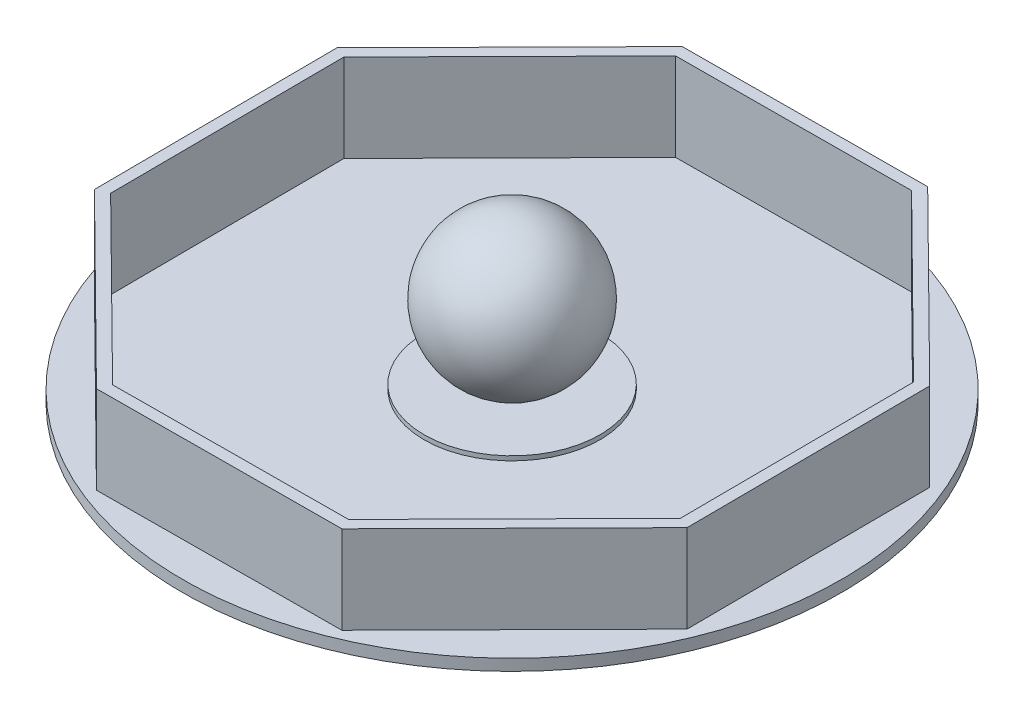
ISO-10303-21;
HEADER;
FILE_DESCRIPTION(('STEP AP214'),'2;1');
FILE_NAME('part.step','',(''),(''),'','','');
FILE_SCHEMA(('AUTOMOTIVE_DESIGN { 1 0 10303 214 1 1 1 1 }'));
ENDSEC;
DATA;
#1=APPLICATION_CONTEXT('core data for automotive mechanical design processes');
#2=APPLICATION_PROTOCOL_DEFINITION('international standard','automotive_design',2000,#1);
#3=PRODUCT_CONTEXT('',#1,'mechanical');
#4=PRODUCT('Part','Part','',(#3));
#5=PRODUCT_RELATED_PRODUCT_CATEGORY('part','',(#4));
#6=PRODUCT_DEFINITION_FORMATION('','',#4);
#7=PRODUCT_DEFINITION_CONTEXT('part definition',#1,'design');
#8=PRODUCT_DEFINITION('design','',#6,#7);
#9=PRODUCT_DEFINITION_SHAPE('','',#8);
#10=(LENGTH_UNIT() NAMED_UNIT(*) SI_UNIT(.MILLI.,.METRE.));
#11=(NAMED_UNIT(*) PLANE_ANGLE_UNIT() SI_UNIT($,.RADIAN.));
#12=(NAMED_UNIT(*) SI_UNIT($,.STERADIAN.) SOLID_ANGLE_UNIT());
#13=UNCERTAINTY_MEASURE_WITH_UNIT(LENGTH_MEASURE(1.E-05),#10,'distance_accuracy_value','');
#14=(GEOMETRIC_REPRESENTATION_CONTEXT(3) GLOBAL_UNCERTAINTY_ASSIGNED_CONTEXT((#13)) GLOBAL_UNIT_ASSIGNED_CONTEXT((#10,
#11,#12)) REPRESENTATION_CONTEXT('',''));
#15=CARTESIAN_POINT('',(0.,0.,0.));
#16=DIRECTION('',(0.,0.,1.));
#17=DIRECTION('',(1.,0.,0.));
#18=AXIS2_PLACEMENT_3D('',#15,#16,#17);
#19=CARTESIAN_POINT('',(0.,25.908,0.));
#20=DIRECTION('',(-1.,0.,0.));
#21=DIRECTION('',(0.,0.,-1.));
#22=AXIS2_PLACEMENT_3D('',#19,#20,#21);
#23=SPHERICAL_SURFACE('',#22,21.336);
#24=CARTESIAN_POINT('',(-21.336,25.908,0.));
#25=VERTEX_POINT('',#24);
#26=VERTEX_LOOP('',#25);
#27=FACE_BOUND('',#26,.T.);
#28=ADVANCED_FACE('F47',(#27),#23,.T.);
#29=CLOSED_SHELL('',(#28));
#30=MANIFOLD_SOLID_BREP('B2',#29);
#31=CARTESIAN_POINT('',(0.,3.302,0.));
#32=DIRECTION('',(0.,1.,0.));
#33=DIRECTION('',(0.,0.,1.));
#34=AXIS2_PLACEMENT_3D('',#31,#32,#33);
#35=PLANE('',#34);
#36=DIRECTION('',(-0.711251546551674,0.,-0.702937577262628));
#37=VECTOR('',#36,1.);
#38=CARTESIAN_POINT('',(81.640686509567,3.302,-34.380363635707));
#39=LINE('',#38,#37);
#40=CARTESIAN_POINT('',(81.6406865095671,3.302,-34.380363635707));
#41=VERTEX_POINT('',#40);
#42=CARTESIAN_POINT('',(33.4180947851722,3.302,-82.0392713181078));
#43=VERTEX_POINT('',#42);
#44=EDGE_CURVE('E86',#41,#43,#39,.T.);
#45=ORIENTED_EDGE('',*,*,#44,.T.);
#46=DIRECTION('',(-0.999982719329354,0.,0.00587886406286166));
#47=VECTOR('',#46,1.);
#48=CARTESIAN_POINT('',(33.4180947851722,3.302,-82.0392713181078));
#49=LINE('',#48,#47);
#50=CARTESIAN_POINT('',(-34.380363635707,3.302,-81.640686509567));
#51=VERTEX_POINT('',#50);
#52=EDGE_CURVE('E195',#43,#51,#49,.T.);
#53=ORIENTED_EDGE('',*,*,#52,.T.);
#54=DIRECTION('',(-0.702937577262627,0.,0.711251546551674));
#55=VECTOR('',#54,1.);
#56=CARTESIAN_POINT('',(-34.380363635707,3.302,-81.640686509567));
#57=LINE('',#56,#55);
#58=CARTESIAN_POINT('',(-82.0392713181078,3.302,-33.4180947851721));
#59=VERTEX_POINT('',#58);
#60=EDGE_CURVE('E231',#51,#59,#57,.T.);
#61=ORIENTED_EDGE('',*,*,#60,.T.);
#62=DIRECTION('',(0.00587886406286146,0.,0.999982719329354));
#63=VECTOR('',#62,1.);
#64=CARTESIAN_POINT('',(-82.0392713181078,3.302,-33.4180947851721));
#65=LINE('',#64,#63);
#66=CARTESIAN_POINT('',(-81.640686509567,3.302,34.380363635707));
#67=VERTEX_POINT('',#66);
#68=EDGE_CURVE('E234',#59,#67,#65,.T.);
#69=ORIENTED_EDGE('',*,*,#68,.T.);
#70=DIRECTION('',(0.711251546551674,0.,0.702937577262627));
#71=VECTOR('',#70,1.);
#72=CARTESIAN_POINT('',(-81.640686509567,3.302,34.380363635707));
#73=LINE('',#72,#71);
#74=CARTESIAN_POINT('',(-33.4180947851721,3.302,82.0392713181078));
#75=VERTEX_POINT('',#74);
#76=EDGE_CURVE('E237',#67,#75,#73,.T.);
#77=ORIENTED_EDGE('',*,*,#76,.T.);
#78=DIRECTION('',(0.999982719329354,0.,-0.00587886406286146));
#79=VECTOR('',#78,1.);
#80=CARTESIAN_POINT('',(-33.4180947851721,3.302,82.0392713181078));
#81=LINE('',#80,#79);
#82=CARTESIAN_POINT('',(34.380363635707,3.302,81.6406865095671));
#83=VERTEX_POINT('',#82);
#84=EDGE_CURVE('E240',#75,#83,#81,.T.);
#85=ORIENTED_EDGE('',*,*,#84,.T.);
#86=DIRECTION('',(0.702937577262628,0.,-0.711251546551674));
#87=VECTOR('',#86,1.);
#88=CARTESIAN_POINT('',(34.380363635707,3.302,81.6406865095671));
#89=LINE('',#88,#87);
#90=CARTESIAN_POINT('',(82.0392713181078,3.302,33.4180947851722));
#91=VERTEX_POINT('',#90);
#92=EDGE_CURVE('E243',#83,#91,#89,.T.);
#93=ORIENTED_EDGE('',*,*,#92,.T.);
#94=DIRECTION('',(-0.00587886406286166,0.,-0.999982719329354));
#95=VECTOR('',#94,1.);
#96=CARTESIAN_POINT('',(82.0392713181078,3.302,33.4180947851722));
#97=LINE('',#96,#95);
#98=EDGE_CURVE('E189',#91,#41,#97,.T.);
#99=ORIENTED_EDGE('',*,*,#98,.T.);
#100=EDGE_LOOP('',(#45,#53,#61,#69,#77,#85,#93,#99));
#101=FACE_BOUND('',#100,.T.);
#102=CARTESIAN_POINT('',(0.,3.302,0.));
#103=DIRECTION('',(0.,1.,0.));
#104=DIRECTION('',(0.,0.,1.));
#105=AXIS2_PLACEMENT_3D('',#102,#103,#104);
#106=CIRCLE('',#105,25.4);
#107=CARTESIAN_POINT('',(0.,3.302,25.4));
#108=VERTEX_POINT('',#107);
#109=EDGE_CURVE('E458',#108,#108,#106,.T.);
#110=ORIENTED_EDGE('',*,*,#109,.F.);
#111=EDGE_LOOP('',(#110));
#112=FACE_BOUND('',#111,.T.);
#113=ADVANCED_FACE('F62',(#101,#112),#35,.T.);
#114=CARTESIAN_POINT('',(0.,3.302,0.));
#115=DIRECTION('',(0.,1.,0.));
#116=DIRECTION('',(0.,0.,1.));
#117=AXIS2_PLACEMENT_3D('',#114,#115,#116);
#118=CIRCLE('',#117,95.25);
#119=CARTESIAN_POINT('',(0.,3.302,-95.25));
#120=VERTEX_POINT('',#119);
#121=EDGE_CURVE('E45',#120,#120,#118,.T.);
#122=ORIENTED_EDGE('',*,*,#121,.T.);
#123=EDGE_LOOP('',(#122));
#124=FACE_BOUND('',#123,.T.);
#125=DIRECTION('',(-0.00587886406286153,0.,-0.999982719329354));
#126=VECTOR('',#125,1.);
#127=CARTESIAN_POINT('',(85.3492549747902,3.302,34.7663923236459));
#128=LINE('',#127,#126);
#129=CARTESIAN_POINT('',(85.3492549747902,3.302,34.7663923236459));
#130=VERTEX_POINT('',#129);
#131=CARTESIAN_POINT('',(84.9345887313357,3.302,-35.7674851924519));
#132=VERTEX_POINT('',#131);
#133=EDGE_CURVE('E302',#130,#132,#128,.T.);
#134=ORIENTED_EDGE('',*,*,#133,.F.);
#135=DIRECTION('',(0.702937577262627,0.,-0.711251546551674));
#136=VECTOR('',#135,1.);
#137=CARTESIAN_POINT('',(35.7674851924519,3.302,84.9345887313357));
#138=LINE('',#137,#136);
#139=CARTESIAN_POINT('',(35.7674851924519,3.302,84.9345887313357));
#140=VERTEX_POINT('',#139);
#141=EDGE_CURVE('E197',#140,#130,#138,.T.);
#142=ORIENTED_EDGE('',*,*,#141,.F.);
#143=DIRECTION('',(0.999982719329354,0.,-0.00587886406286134));
#144=VECTOR('',#143,1.);
#145=CARTESIAN_POINT('',(-34.7663923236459,3.302,85.3492549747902));
#146=LINE('',#145,#144);
#147=CARTESIAN_POINT('',(-34.7663923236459,3.302,85.3492549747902));
#148=VERTEX_POINT('',#147);
#149=EDGE_CURVE('E277',#148,#140,#146,.T.);
#150=ORIENTED_EDGE('',*,*,#149,.F.);
#151=DIRECTION('',(0.711251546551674,0.,0.702937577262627));
#152=VECTOR('',#151,1.);
#153=CARTESIAN_POINT('',(-84.9345887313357,3.302,35.7674851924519));
#154=LINE('',#153,#152);
#155=CARTESIAN_POINT('',(-84.9345887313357,3.302,35.7674851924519));
#156=VERTEX_POINT('',#155);
#157=EDGE_CURVE('E317',#156,#148,#154,.T.);
#158=ORIENTED_EDGE('',*,*,#157,.F.);
#159=DIRECTION('',(0.00587886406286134,0.,0.999982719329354));
#160=VECTOR('',#159,1.);
#161=CARTESIAN_POINT('',(-85.3492549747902,3.302,-34.7663923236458));
#162=LINE('',#161,#160);
#163=CARTESIAN_POINT('',(-85.3492549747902,3.302,-34.7663923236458));
#164=VERTEX_POINT('',#163);
#165=EDGE_CURVE('E314',#164,#156,#162,.T.);
#166=ORIENTED_EDGE('',*,*,#165,.F.);
#167=DIRECTION('',(-0.702937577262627,0.,0.711251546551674));
#168=VECTOR('',#167,1.);
#169=CARTESIAN_POINT('',(-35.7674851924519,3.302,-84.9345887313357));
#170=LINE('',#169,#168);
#171=CARTESIAN_POINT('',(-35.7674851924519,3.302,-84.9345887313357));
#172=VERTEX_POINT('',#171);
#173=EDGE_CURVE('E311',#172,#164,#170,.T.);
#174=ORIENTED_EDGE('',*,*,#173,.F.);
#175=DIRECTION('',(-0.999982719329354,0.,0.00587886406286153));
#176=VECTOR('',#175,1.);
#177=CARTESIAN_POINT('',(34.7663923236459,3.302,-85.3492549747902));
#178=LINE('',#177,#176);
#179=CARTESIAN_POINT('',(34.7663923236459,3.302,-85.3492549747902));
#180=VERTEX_POINT('',#179);
#181=EDGE_CURVE('E308',#180,#172,#178,.T.);
#182=ORIENTED_EDGE('',*,*,#181,.F.);
#183=DIRECTION('',(-0.711251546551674,0.,-0.702937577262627));
#184=VECTOR('',#183,1.);
#185=CARTESIAN_POINT('',(84.9345887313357,3.302,-35.7674851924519));
#186=LINE('',#185,#184);
#187=EDGE_CURVE('E305',#132,#180,#186,.T.);
#188=ORIENTED_EDGE('',*,*,#187,.F.);
#189=EDGE_LOOP('',(#134,#142,#150,#158,#166,#174,#182,#188));
#190=FACE_BOUND('',#189,.T.);
#191=ADVANCED_FACE('F362',(#124,#190),#35,.T.);
#192=CARTESIAN_POINT('',(0.,0.,0.));
#193=DIRECTION('',(0.,1.,0.));
#194=DIRECTION('',(0.,0.,1.));
#195=AXIS2_PLACEMENT_3D('',#192,#193,#194);
#196=PLANE('',#195);
#197=CARTESIAN_POINT('',(0.,0.,0.));
#198=DIRECTION('',(0.,1.,0.));
#199=DIRECTION('',(0.,0.,1.));
#200=AXIS2_PLACEMENT_3D('',#197,#198,#199);
#201=CIRCLE('',#200,95.25);
#202=CARTESIAN_POINT('',(0.,0.,-95.25));
#203=VERTEX_POINT('',#202);
#204=EDGE_CURVE('E66',#203,#203,#201,.T.);
#205=ORIENTED_EDGE('',*,*,#204,.F.);
#206=EDGE_LOOP('',(#205));
#207=FACE_BOUND('',#206,.T.);
#208=CARTESIAN_POINT('',(0.,0.,0.));
#209=DIRECTION('',(0.,1.,0.));
#210=DIRECTION('',(0.,0.,1.));
#211=AXIS2_PLACEMENT_3D('',#208,#209,#210);
#212=CIRCLE('',#211,3.175);
#213=CARTESIAN_POINT('',(0.,0.,-3.175));
#214=VERTEX_POINT('',#213);
#215=EDGE_CURVE('E350',#214,#214,#212,.T.);
#216=ORIENTED_EDGE('',*,*,#215,.T.);
#217=EDGE_LOOP('',(#216));
#218=FACE_BOUND('',#217,.T.);
#219=ADVANCED_FACE('F360',(#207,#218),#196,.F.);
#220=CARTESIAN_POINT('',(0.,3.302,0.));
#221=DIRECTION('',(0.,-1.,0.));
#222=DIRECTION('',(0.,0.,-1.));
#223=AXIS2_PLACEMENT_3D('',#220,#221,#222);
#224=CYLINDRICAL_SURFACE('',#223,95.25);
#225=CARTESIAN_POINT('',(0.,3.302,-95.25));
#226=CARTESIAN_POINT('',(0.,3.26760416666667,-95.25));
#227=CARTESIAN_POINT('',(0.,3.23320833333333,-95.25));
#228=CARTESIAN_POINT('',(0.,3.16441666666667,-95.25));
#229=CARTESIAN_POINT('',(0.,3.13002083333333,-95.25));
#230=CARTESIAN_POINT('',(0.,3.06122916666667,-95.25));
#231=CARTESIAN_POINT('',(0.,3.02683333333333,-95.25));
#232=CARTESIAN_POINT('',(0.,2.95804166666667,-95.25));
#233=CARTESIAN_POINT('',(0.,2.92364583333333,-95.25));
#234=CARTESIAN_POINT('',(0.,2.85485416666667,-95.25));
#235=CARTESIAN_POINT('',(0.,2.82045833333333,-95.25));
#236=CARTESIAN_POINT('',(0.,2.75166666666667,-95.25));
#237=CARTESIAN_POINT('',(0.,2.71727083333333,-95.25));
#238=CARTESIAN_POINT('',(0.,2.64847916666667,-95.25));
#239=CARTESIAN_POINT('',(0.,2.61408333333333,-95.25));
#240=CARTESIAN_POINT('',(0.,2.54529166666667,-95.25));
#241=CARTESIAN_POINT('',(0.,2.51089583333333,-95.25));
#242=CARTESIAN_POINT('',(0.,2.44210416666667,-95.25));
#243=CARTESIAN_POINT('',(0.,2.40770833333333,-95.25));
#244=CARTESIAN_POINT('',(0.,2.33891666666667,-95.25));
#245=CARTESIAN_POINT('',(0.,2.30452083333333,-95.25));
#246=CARTESIAN_POINT('',(0.,2.23572916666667,-95.25));
#247=CARTESIAN_POINT('',(0.,2.20133333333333,-95.25));
#248=CARTESIAN_POINT('',(0.,2.13254166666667,-95.25));
#249=CARTESIAN_POINT('',(0.,2.09814583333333,-95.25));
#250=CARTESIAN_POINT('',(0.,2.02935416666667,-95.25));
#251=CARTESIAN_POINT('',(0.,1.99495833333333,-95.25));
#252=CARTESIAN_POINT('',(0.,1.92616666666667,-95.25));
#253=CARTESIAN_POINT('',(0.,1.89177083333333,-95.25));
#254=CARTESIAN_POINT('',(0.,1.82297916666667,-95.25));
#255=CARTESIAN_POINT('',(0.,1.78858333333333,-95.25));
#256=CARTESIAN_POINT('',(0.,1.71979166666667,-95.25));
#257=CARTESIAN_POINT('',(0.,1.68539583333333,-95.25));
#258=CARTESIAN_POINT('',(0.,1.61660416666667,-95.25));
#259=CARTESIAN_POINT('',(0.,1.58220833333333,-95.25));
#260=CARTESIAN_POINT('',(0.,1.51341666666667,-95.25));
#261=CARTESIAN_POINT('',(0.,1.47902083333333,-95.25));
#262=CARTESIAN_POINT('',(0.,1.41022916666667,-95.25));
#263=CARTESIAN_POINT('',(0.,1.37583333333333,-95.25));
#264=CARTESIAN_POINT('',(0.,1.30704166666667,-95.25));
#265=CARTESIAN_POINT('',(0.,1.27264583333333,-95.25));
#266=CARTESIAN_POINT('',(0.,1.20385416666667,-95.25));
#267=CARTESIAN_POINT('',(0.,1.16945833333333,-95.25));
#268=CARTESIAN_POINT('',(0.,1.10066666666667,-95.25));
#269=CARTESIAN_POINT('',(0.,1.06627083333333,-95.25));
#270=CARTESIAN_POINT('',(0.,0.997479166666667,-95.25));
#271=CARTESIAN_POINT('',(0.,0.963083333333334,-95.25));
#272=CARTESIAN_POINT('',(0.,0.894291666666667,-95.25));
#273=CARTESIAN_POINT('',(0.,0.859895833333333,-95.25));
#274=CARTESIAN_POINT('',(0.,0.791104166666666,-95.25));
#275=CARTESIAN_POINT('',(0.,0.756708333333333,-95.25));
#276=CARTESIAN_POINT('',(0.,0.687916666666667,-95.25));
#277=CARTESIAN_POINT('',(0.,0.653520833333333,-95.25));
#278=CARTESIAN_POINT('',(0.,0.584729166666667,-95.25));
#279=CARTESIAN_POINT('',(0.,0.550333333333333,-95.25));
#280=CARTESIAN_POINT('',(0.,0.481541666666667,-95.25));
#281=CARTESIAN_POINT('',(0.,0.447145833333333,-95.25));
#282=CARTESIAN_POINT('',(0.,0.378354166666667,-95.25));
#283=CARTESIAN_POINT('',(0.,0.343958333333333,-95.25));
#284=CARTESIAN_POINT('',(0.,0.275166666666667,-95.25));
#285=CARTESIAN_POINT('',(0.,0.240770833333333,-95.25));
#286=CARTESIAN_POINT('',(0.,0.171979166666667,-95.25));
#287=CARTESIAN_POINT('',(0.,0.137583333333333,-95.25));
#288=CARTESIAN_POINT('',(0.,0.0687916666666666,-95.25));
#289=CARTESIAN_POINT('',(0.,0.0343958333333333,-95.25));
#290=CARTESIAN_POINT('',(0.,0.,-95.25));
#291=B_SPLINE_CURVE_WITH_KNOTS('',3,(#225,#226,#227,#228,#229,#230,#231,#232,#233,#234,#235,
#236,#237,#238,#239,#240,#241,#242,#243,#244,#245,#246,#247,#248,#249,#250,#251,#252,#253,#254,
#255,#256,#257,#258,#259,#260,#261,#262,#263,#264,#265,#266,#267,#268,#269,#270,#271,#272,#273,
#274,#275,#276,#277,#278,#279,#280,#281,#282,#283,#284,#285,#286,#287,#288,#289,#290),
.UNSPECIFIED.,.F.,.F.,(4,2,2,2,2,2,2,2,2,2,2,2,2,2,2,2,2,2,2,2,2,2,2,2,2,2,2,2,2,2,2,2,4),(0.,
0.1031875,0.206375,0.3095625,0.41275,0.5159375,0.619125,0.7223125,0.8255,0.9286875,1.031875,
1.1350625,1.23825,1.3414375,1.444625,1.5478125,1.651,1.7541875,1.857375,1.9605625,2.06375,
2.1669375,2.270125,2.3733125,2.4765,2.5796875,2.682875,2.7860625,2.88925,2.9924375,3.095625,
3.1988125,3.302),.UNSPECIFIED.);
#292=EDGE_CURVE('BSEAM64',#120,#203,#291,.T.);
#293=ORIENTED_EDGE('',*,*,#121,.F.);
#294=ORIENTED_EDGE('',*,*,#204,.T.);
#295=ORIENTED_EDGE('',*,*,#292,.T.);
#296=ORIENTED_EDGE('',*,*,#292,.F.);
#297=EDGE_LOOP('',(#293,#295,#294,#296));
#298=FACE_BOUND('',#297,.T.);
#299=ADVANCED_FACE('F64',(#298),#224,.T.);
#300=CARTESIAN_POINT('',(0.,3.302,0.));
#301=DIRECTION('',(0.,-1.,0.));
#302=DIRECTION('',(0.,0.,-1.));
#303=AXIS2_PLACEMENT_3D('',#300,#301,#302);
#304=CYLINDRICAL_SURFACE('',#303,3.175);
#305=CARTESIAN_POINT('',(0.,4.572,0.));
#306=DIRECTION('',(0.,1.,0.));
#307=DIRECTION('',(0.,0.,1.));
#308=AXIS2_PLACEMENT_3D('',#305,#306,#307);
#309=CIRCLE('',#308,3.175);
#310=CARTESIAN_POINT('',(0.,4.572,-3.175));
#311=VERTEX_POINT('',#310);
#312=EDGE_CURVE('E455',#311,#311,#309,.T.);
#313=CARTESIAN_POINT('',(0.,0.,-3.175));
#314=CARTESIAN_POINT('',(0.,0.0476249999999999,-3.175));
#315=CARTESIAN_POINT('',(0.,0.0952499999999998,-3.175));
#316=CARTESIAN_POINT('',(0.,0.1905,-3.175));
#317=CARTESIAN_POINT('',(0.,0.238125,-3.175));
#318=CARTESIAN_POINT('',(0.,0.333375,-3.175));
#319=CARTESIAN_POINT('',(0.,0.381,-3.175));
#320=CARTESIAN_POINT('',(0.,0.47625,-3.175));
#321=CARTESIAN_POINT('',(0.,0.523875,-3.175));
#322=CARTESIAN_POINT('',(0.,0.619125,-3.175));
#323=CARTESIAN_POINT('',(0.,0.66675,-3.175));
#324=CARTESIAN_POINT('',(0.,0.762,-3.175));
#325=CARTESIAN_POINT('',(0.,0.809625,-3.175));
#326=CARTESIAN_POINT('',(0.,0.904875,-3.175));
#327=CARTESIAN_POINT('',(0.,0.9525,-3.175));
#328=CARTESIAN_POINT('',(0.,1.04775,-3.175));
#329=CARTESIAN_POINT('',(0.,1.095375,-3.175));
#330=CARTESIAN_POINT('',(0.,1.190625,-3.175));
#331=CARTESIAN_POINT('',(0.,1.23825,-3.175));
#332=CARTESIAN_POINT('',(0.,1.3335,-3.175));
#333=CARTESIAN_POINT('',(0.,1.381125,-3.175));
#334=CARTESIAN_POINT('',(0.,1.476375,-3.175));
#335=CARTESIAN_POINT('',(0.,1.524,-3.175));
#336=CARTESIAN_POINT('',(0.,1.61925,-3.175));
#337=CARTESIAN_POINT('',(0.,1.666875,-3.175));
#338=CARTESIAN_POINT('',(0.,1.762125,-3.175));
#339=CARTESIAN_POINT('',(0.,1.80975,-3.175));
#340=CARTESIAN_POINT('',(0.,1.905,-3.175));
#341=CARTESIAN_POINT('',(0.,1.952625,-3.175));
#342=CARTESIAN_POINT('',(0.,2.047875,-3.175));
#343=CARTESIAN_POINT('',(0.,2.0955,-3.175));
#344=CARTESIAN_POINT('',(0.,2.19075,-3.175));
#345=CARTESIAN_POINT('',(0.,2.238375,-3.175));
#346=CARTESIAN_POINT('',(0.,2.333625,-3.175));
#347=CARTESIAN_POINT('',(0.,2.38125,-3.175));
#348=CARTESIAN_POINT('',(0.,2.4765,-3.175));
#349=CARTESIAN_POINT('',(0.,2.524125,-3.175));
#350=CARTESIAN_POINT('',(0.,2.619375,-3.175));
#351=CARTESIAN_POINT('',(0.,2.667,-3.175));
#352=CARTESIAN_POINT('',(0.,2.76225,-3.175));
#353=CARTESIAN_POINT('',(0.,2.809875,-3.175));
#354=CARTESIAN_POINT('',(0.,2.905125,-3.175));
#355=CARTESIAN_POINT('',(0.,2.95275,-3.175));
#356=CARTESIAN_POINT('',(0.,3.048,-3.175));
#357=CARTESIAN_POINT('',(0.,3.095625,-3.175));
#358=CARTESIAN_POINT('',(0.,3.190875,-3.175));
#359=CARTESIAN_POINT('',(0.,3.2385,-3.175));
#360=CARTESIAN_POINT('',(0.,3.33375,-3.175));
#361=CARTESIAN_POINT('',(0.,3.381375,-3.175));
#362=CARTESIAN_POINT('',(0.,3.476625,-3.175));
#363=CARTESIAN_POINT('',(0.,3.52425,-3.175));
#364=CARTESIAN_POINT('',(0.,3.6195,-3.175));
#365=CARTESIAN_POINT('',(0.,3.667125,-3.175));
#366=CARTESIAN_POINT('',(0.,3.762375,-3.175));
#367=CARTESIAN_POINT('',(0.,3.81,-3.175));
#368=CARTESIAN_POINT('',(0.,3.90525,-3.175));
#369=CARTESIAN_POINT('',(0.,3.952875,-3.175));
#370=CARTESIAN_POINT('',(0.,4.048125,-3.175));
#371=CARTESIAN_POINT('',(0.,4.09575,-3.175));
#372=CARTESIAN_POINT('',(0.,4.191,-3.175));
#373=CARTESIAN_POINT('',(0.,4.238625,-3.175));
#374=CARTESIAN_POINT('',(0.,4.333875,-3.175));
#375=CARTESIAN_POINT('',(0.,4.3815,-3.175));
#376=CARTESIAN_POINT('',(0.,4.47675,-3.175));
#377=CARTESIAN_POINT('',(0.,4.524375,-3.175));
#378=CARTESIAN_POINT('',(0.,4.572,-3.175));
#379=B_SPLINE_CURVE_WITH_KNOTS('',3,(#313,#314,#315,#316,#317,#318,#319,#320,#321,#322,#323,
#324,#325,#326,#327,#328,#329,#330,#331,#332,#333,#334,#335,#336,#337,#338,#339,#340,#341,#342,
#343,#344,#345,#346,#347,#348,#349,#350,#351,#352,#353,#354,#355,#356,#357,#358,#359,#360,#361,
#362,#363,#364,#365,#366,#367,#368,#369,#370,#371,#372,#373,#374,#375,#376,#377,#378),
.UNSPECIFIED.,.F.,.F.,(4,2,2,2,2,2,2,2,2,2,2,2,2,2,2,2,2,2,2,2,2,2,2,2,2,2,2,2,2,2,2,2,4),(0.,
0.142875,0.28575,0.428625,0.5715,0.714375,0.85725,1.000125,1.143,1.285875,1.42875,1.571625,
1.7145,1.857375,2.00025,2.143125,2.286,2.428875,2.57175,2.714625,2.8575,3.000375,3.14325,
3.286125,3.429,3.571875,3.71475,3.857625,4.0005,4.143375,4.28625,4.429125,4.572),.UNSPECIFIED.);
#380=EDGE_CURVE('BSEAM367',#214,#311,#379,.T.);
#381=ORIENTED_EDGE('',*,*,#215,.F.);
#382=ORIENTED_EDGE('',*,*,#312,.T.);
#383=ORIENTED_EDGE('',*,*,#380,.T.);
#384=ORIENTED_EDGE('',*,*,#380,.F.);
#385=EDGE_LOOP('',(#381,#383,#382,#384));
#386=FACE_BOUND('',#385,.T.);
#387=ADVANCED_FACE('F367',(#386),#304,.F.);
#388=CARTESIAN_POINT('',(0.,28.702,0.));
#389=DIRECTION('',(0.,1.,0.));
#390=DIRECTION('',(0.,0.,1.));
#391=AXIS2_PLACEMENT_3D('',#388,#389,#390);
#392=PLANE('',#391);
#393=DIRECTION('',(0.702937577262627,0.,-0.711251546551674));
#394=VECTOR('',#393,1.);
#395=CARTESIAN_POINT('',(35.7674851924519,28.702,84.9345887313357));
#396=LINE('',#395,#394);
#397=CARTESIAN_POINT('',(35.7674851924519,28.702,84.9345887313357));
#398=VERTEX_POINT('',#397);
#399=CARTESIAN_POINT('',(85.3492549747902,28.702,34.7663923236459));
#400=VERTEX_POINT('',#399);
#401=EDGE_CURVE('E272',#398,#400,#396,.T.);
#402=ORIENTED_EDGE('',*,*,#401,.T.);
#403=DIRECTION('',(-0.00587886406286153,0.,-0.999982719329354));
#404=VECTOR('',#403,1.);
#405=CARTESIAN_POINT('',(85.3492549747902,28.702,34.7663923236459));
#406=LINE('',#405,#404);
#407=CARTESIAN_POINT('',(84.9345887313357,28.702,-35.7674851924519));
#408=VERTEX_POINT('',#407);
#409=EDGE_CURVE('E276',#400,#408,#406,.T.);
#410=ORIENTED_EDGE('',*,*,#409,.T.);
#411=DIRECTION('',(-0.711251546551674,0.,-0.702937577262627));
#412=VECTOR('',#411,1.);
#413=CARTESIAN_POINT('',(84.9345887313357,28.702,-35.7674851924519));
#414=LINE('',#413,#412);
#415=CARTESIAN_POINT('',(34.7663923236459,28.702,-85.3492549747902));
#416=VERTEX_POINT('',#415);
#417=EDGE_CURVE('E280',#408,#416,#414,.T.);
#418=ORIENTED_EDGE('',*,*,#417,.T.);
#419=DIRECTION('',(-0.999982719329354,0.,0.00587886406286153));
#420=VECTOR('',#419,1.);
#421=CARTESIAN_POINT('',(34.7663923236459,28.702,-85.3492549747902));
#422=LINE('',#421,#420);
#423=CARTESIAN_POINT('',(-35.7674851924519,28.702,-84.9345887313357));
#424=VERTEX_POINT('',#423);
#425=EDGE_CURVE('E283',#416,#424,#422,.T.);
#426=ORIENTED_EDGE('',*,*,#425,.T.);
#427=DIRECTION('',(-0.702937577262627,0.,0.711251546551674));
#428=VECTOR('',#427,1.);
#429=CARTESIAN_POINT('',(-35.7674851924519,28.702,-84.9345887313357));
#430=LINE('',#429,#428);
#431=CARTESIAN_POINT('',(-85.3492549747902,28.702,-34.7663923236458));
#432=VERTEX_POINT('',#431);
#433=EDGE_CURVE('E286',#424,#432,#430,.T.);
#434=ORIENTED_EDGE('',*,*,#433,.T.);
#435=DIRECTION('',(0.00587886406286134,0.,0.999982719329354));
#436=VECTOR('',#435,1.);
#437=CARTESIAN_POINT('',(-85.3492549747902,28.702,-34.7663923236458));
#438=LINE('',#437,#436);
#439=CARTESIAN_POINT('',(-84.9345887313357,28.702,35.7674851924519));
#440=VERTEX_POINT('',#439);
#441=EDGE_CURVE('E289',#432,#440,#438,.T.);
#442=ORIENTED_EDGE('',*,*,#441,.T.);
#443=DIRECTION('',(0.711251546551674,0.,0.702937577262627));
#444=VECTOR('',#443,1.);
#445=CARTESIAN_POINT('',(-84.9345887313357,28.702,35.7674851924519));
#446=LINE('',#445,#444);
#447=CARTESIAN_POINT('',(-34.7663923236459,28.702,85.3492549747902));
#448=VERTEX_POINT('',#447);
#449=EDGE_CURVE('E292',#440,#448,#446,.T.);
#450=ORIENTED_EDGE('',*,*,#449,.T.);
#451=DIRECTION('',(0.999982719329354,0.,-0.00587886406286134));
#452=VECTOR('',#451,1.);
#453=CARTESIAN_POINT('',(-34.7663923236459,28.702,85.3492549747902));
#454=LINE('',#453,#452);
#455=EDGE_CURVE('E295',#448,#398,#454,.T.);
#456=ORIENTED_EDGE('',*,*,#455,.T.);
#457=EDGE_LOOP('',(#402,#410,#418,#426,#434,#442,#450,#456));
#458=FACE_BOUND('',#457,.T.);
#459=DIRECTION('',(-0.999982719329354,0.,0.00587886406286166));
#460=VECTOR('',#459,1.);
#461=CARTESIAN_POINT('',(33.4180947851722,28.702,-82.0392713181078));
#462=LINE('',#461,#460);
#463=CARTESIAN_POINT('',(33.4180947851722,28.702,-82.0392713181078));
#464=VERTEX_POINT('',#463);
#465=CARTESIAN_POINT('',(-34.380363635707,28.702,-81.640686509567));
#466=VERTEX_POINT('',#465);
#467=EDGE_CURVE('E188',#464,#466,#462,.T.);
#468=ORIENTED_EDGE('',*,*,#467,.F.);
#469=DIRECTION('',(-0.711251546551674,0.,-0.702937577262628));
#470=VECTOR('',#469,1.);
#471=CARTESIAN_POINT('',(81.640686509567,28.702,-34.380363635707));
#472=LINE('',#471,#470);
#473=CARTESIAN_POINT('',(81.640686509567,28.702,-34.380363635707));
#474=VERTEX_POINT('',#473);
#475=EDGE_CURVE('E178',#474,#464,#472,.T.);
#476=ORIENTED_EDGE('',*,*,#475,.F.);
#477=DIRECTION('',(-0.00587886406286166,0.,-0.999982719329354));
#478=VECTOR('',#477,1.);
#479=CARTESIAN_POINT('',(82.0392713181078,28.702,33.4180947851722));
#480=LINE('',#479,#478);
#481=CARTESIAN_POINT('',(82.0392713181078,28.702,33.4180947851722));
#482=VERTEX_POINT('',#481);
#483=EDGE_CURVE('E223',#482,#474,#480,.T.);
#484=ORIENTED_EDGE('',*,*,#483,.F.);
#485=DIRECTION('',(0.702937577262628,0.,-0.711251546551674));
#486=VECTOR('',#485,1.);
#487=CARTESIAN_POINT('',(34.380363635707,28.702,81.6406865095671));
#488=LINE('',#487,#486);
#489=CARTESIAN_POINT('',(34.380363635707,28.702,81.6406865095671));
#490=VERTEX_POINT('',#489);
#491=EDGE_CURVE('E219',#490,#482,#488,.T.);
#492=ORIENTED_EDGE('',*,*,#491,.F.);
#493=DIRECTION('',(0.999982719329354,0.,-0.00587886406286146));
#494=VECTOR('',#493,1.);
#495=CARTESIAN_POINT('',(-33.4180947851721,28.702,82.0392713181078));
#496=LINE('',#495,#494);
#497=CARTESIAN_POINT('',(-33.4180947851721,28.702,82.0392713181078));
#498=VERTEX_POINT('',#497);
#499=EDGE_CURVE('E216',#498,#490,#496,.T.);
#500=ORIENTED_EDGE('',*,*,#499,.F.);
#501=DIRECTION('',(0.711251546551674,0.,0.702937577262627));
#502=VECTOR('',#501,1.);
#503=CARTESIAN_POINT('',(-81.640686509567,28.702,34.380363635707));
#504=LINE('',#503,#502);
#505=CARTESIAN_POINT('',(-81.640686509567,28.702,34.380363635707));
#506=VERTEX_POINT('',#505);
#507=EDGE_CURVE('E213',#506,#498,#504,.T.);
#508=ORIENTED_EDGE('',*,*,#507,.F.);
#509=DIRECTION('',(0.00587886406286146,0.,0.999982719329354));
#510=VECTOR('',#509,1.);
#511=CARTESIAN_POINT('',(-82.0392713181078,28.702,-33.4180947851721));
#512=LINE('',#511,#510);
#513=CARTESIAN_POINT('',(-82.0392713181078,28.702,-33.4180947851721));
#514=VERTEX_POINT('',#513);
#515=EDGE_CURVE('E207',#514,#506,#512,.T.);
#516=ORIENTED_EDGE('',*,*,#515,.F.);
#517=DIRECTION('',(-0.702937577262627,0.,0.711251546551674));
#518=VECTOR('',#517,1.);
#519=CARTESIAN_POINT('',(-34.380363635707,28.702,-81.640686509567));
#520=LINE('',#519,#518);
#521=EDGE_CURVE('E203',#466,#514,#520,.T.);
#522=ORIENTED_EDGE('',*,*,#521,.F.);
#523=EDGE_LOOP('',(#468,#476,#484,#492,#500,#508,#516,#522));
#524=FACE_BOUND('',#523,.T.);
#525=ADVANCED_FACE('F201',(#458,#524),#392,.T.);
#526=CARTESIAN_POINT('',(35.7674851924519,28.702,84.9345887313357));
#527=DIRECTION('',(-0.711251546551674,0.,-0.702937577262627));
#528=DIRECTION('',(-0.702937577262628,0.,0.711251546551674));
#529=AXIS2_PLACEMENT_3D('',#526,#527,#528);
#530=PLANE('',#529);
#531=ORIENTED_EDGE('',*,*,#141,.T.);
#532=DIRECTION('',(0.,-1.,0.));
#533=VECTOR('',#532,1.);
#534=CARTESIAN_POINT('',(85.3492549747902,28.702,34.7663923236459));
#535=LINE('',#534,#533);
#536=EDGE_CURVE('E347',#400,#130,#535,.T.);
#537=ORIENTED_EDGE('',*,*,#536,.F.);
#538=ORIENTED_EDGE('',*,*,#401,.F.);
#539=DIRECTION('',(0.,-1.,0.));
#540=VECTOR('',#539,1.);
#541=CARTESIAN_POINT('',(35.7674851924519,28.702,84.9345887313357));
#542=LINE('',#541,#540);
#543=EDGE_CURVE('E298',#398,#140,#542,.T.);
#544=ORIENTED_EDGE('',*,*,#543,.T.);
#545=EDGE_LOOP('',(#531,#537,#538,#544));
#546=FACE_BOUND('',#545,.T.);
#547=ADVANCED_FACE('F379',(#546),#530,.F.);
#548=CARTESIAN_POINT('',(85.3492549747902,28.702,34.7663923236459));
#549=DIRECTION('',(-0.999982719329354,0.,0.00587886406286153));
#550=DIRECTION('',(0.00587886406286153,0.,0.999982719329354));
#551=AXIS2_PLACEMENT_3D('',#548,#549,#550);
#552=PLANE('',#551);
#553=ORIENTED_EDGE('',*,*,#133,.T.);
#554=DIRECTION('',(0.,-1.,0.));
#555=VECTOR('',#554,1.);
#556=CARTESIAN_POINT('',(84.9345887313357,28.702,-35.7674851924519));
#557=LINE('',#556,#555);
#558=EDGE_CURVE('E343',#408,#132,#557,.T.);
#559=ORIENTED_EDGE('',*,*,#558,.F.);
#560=ORIENTED_EDGE('',*,*,#409,.F.);
#561=ORIENTED_EDGE('',*,*,#536,.T.);
#562=EDGE_LOOP('',(#553,#559,#560,#561));
#563=FACE_BOUND('',#562,.T.);
#564=ADVANCED_FACE('F382',(#563),#552,.F.);
#565=CARTESIAN_POINT('',(84.9345887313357,28.702,-35.7674851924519));
#566=DIRECTION('',(-0.702937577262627,0.,0.711251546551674));
#567=DIRECTION('',(0.711251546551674,0.,0.702937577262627));
#568=AXIS2_PLACEMENT_3D('',#565,#566,#567);
#569=PLANE('',#568);
#570=ORIENTED_EDGE('',*,*,#187,.T.);
#571=DIRECTION('',(0.,-1.,0.));
#572=VECTOR('',#571,1.);
#573=CARTESIAN_POINT('',(34.7663923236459,28.702,-85.3492549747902));
#574=LINE('',#573,#572);
#575=EDGE_CURVE('E339',#416,#180,#574,.T.);
#576=ORIENTED_EDGE('',*,*,#575,.F.);
#577=ORIENTED_EDGE('',*,*,#417,.F.);
#578=ORIENTED_EDGE('',*,*,#558,.T.);
#579=EDGE_LOOP('',(#570,#576,#577,#578));
#580=FACE_BOUND('',#579,.T.);
#581=ADVANCED_FACE('F386',(#580),#569,.F.);
#582=CARTESIAN_POINT('',(34.7663923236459,28.702,-85.3492549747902));
#583=DIRECTION('',(0.00587886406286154,0.,0.999982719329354));
#584=DIRECTION('',(0.999982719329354,0.,-0.00587886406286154));
#585=AXIS2_PLACEMENT_3D('',#582,#583,#584);
#586=PLANE('',#585);
#587=ORIENTED_EDGE('',*,*,#181,.T.);
#588=DIRECTION('',(0.,-1.,0.));
#589=VECTOR('',#588,1.);
#590=CARTESIAN_POINT('',(-35.7674851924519,28.702,-84.9345887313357));
#591=LINE('',#590,#589);
#592=EDGE_CURVE('E335',#424,#172,#591,.T.);
#593=ORIENTED_EDGE('',*,*,#592,.F.);
#594=ORIENTED_EDGE('',*,*,#425,.F.);
#595=ORIENTED_EDGE('',*,*,#575,.T.);
#596=EDGE_LOOP('',(#587,#593,#594,#595));
#597=FACE_BOUND('',#596,.T.);
#598=ADVANCED_FACE('F390',(#597),#586,.F.);
#599=CARTESIAN_POINT('',(-35.7674851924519,28.702,-84.9345887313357));
#600=DIRECTION('',(0.711251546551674,0.,0.702937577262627));
#601=DIRECTION('',(0.702937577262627,0.,-0.711251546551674));
#602=AXIS2_PLACEMENT_3D('',#599,#600,#601);
#603=PLANE('',#602);
#604=ORIENTED_EDGE('',*,*,#173,.T.);
#605=DIRECTION('',(0.,-1.,0.));
#606=VECTOR('',#605,1.);
#607=CARTESIAN_POINT('',(-85.3492549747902,28.702,-34.7663923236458));
#608=LINE('',#607,#606);
#609=EDGE_CURVE('E331',#432,#164,#608,.T.);
#610=ORIENTED_EDGE('',*,*,#609,.F.);
#611=ORIENTED_EDGE('',*,*,#433,.F.);
#612=ORIENTED_EDGE('',*,*,#592,.T.);
#613=EDGE_LOOP('',(#604,#610,#611,#612));
#614=FACE_BOUND('',#613,.T.);
#615=ADVANCED_FACE('F394',(#614),#603,.F.);
#616=CARTESIAN_POINT('',(-85.3492549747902,28.702,-34.7663923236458));
#617=DIRECTION('',(0.999982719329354,0.,-0.00587886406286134));
#618=DIRECTION('',(-0.00587886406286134,0.,-0.999982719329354));
#619=AXIS2_PLACEMENT_3D('',#616,#617,#618);
#620=PLANE('',#619);
#621=ORIENTED_EDGE('',*,*,#165,.T.);
#622=DIRECTION('',(0.,-1.,0.));
#623=VECTOR('',#622,1.);
#624=CARTESIAN_POINT('',(-84.9345887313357,28.702,35.7674851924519));
#625=LINE('',#624,#623);
#626=EDGE_CURVE('E327',#440,#156,#625,.T.);
#627=ORIENTED_EDGE('',*,*,#626,.F.);
#628=ORIENTED_EDGE('',*,*,#441,.F.);
#629=ORIENTED_EDGE('',*,*,#609,.T.);
#630=EDGE_LOOP('',(#621,#627,#628,#629));
#631=FACE_BOUND('',#630,.T.);
#632=ADVANCED_FACE('F398',(#631),#620,.F.);
#633=CARTESIAN_POINT('',(-84.9345887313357,28.702,35.7674851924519));
#634=DIRECTION('',(0.702937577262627,0.,-0.711251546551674));
#635=DIRECTION('',(-0.711251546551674,0.,-0.702937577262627));
#636=AXIS2_PLACEMENT_3D('',#633,#634,#635);
#637=PLANE('',#636);
#638=ORIENTED_EDGE('',*,*,#157,.T.);
#639=DIRECTION('',(0.,-1.,0.));
#640=VECTOR('',#639,1.);
#641=CARTESIAN_POINT('',(-34.7663923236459,28.702,85.3492549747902));
#642=LINE('',#641,#640);
#643=EDGE_CURVE('E78',#448,#148,#642,.T.);
#644=ORIENTED_EDGE('',*,*,#643,.F.);
#645=ORIENTED_EDGE('',*,*,#449,.F.);
#646=ORIENTED_EDGE('',*,*,#626,.T.);
#647=EDGE_LOOP('',(#638,#644,#645,#646));
#648=FACE_BOUND('',#647,.T.);
#649=ADVANCED_FACE('F402',(#648),#637,.F.);
#650=CARTESIAN_POINT('',(-34.7663923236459,28.702,85.3492549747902));
#651=DIRECTION('',(-0.00587886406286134,0.,-0.999982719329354));
#652=DIRECTION('',(-0.999982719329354,0.,0.00587886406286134));
#653=AXIS2_PLACEMENT_3D('',#650,#651,#652);
#654=PLANE('',#653);
#655=ORIENTED_EDGE('',*,*,#149,.T.);
#656=ORIENTED_EDGE('',*,*,#543,.F.);
#657=ORIENTED_EDGE('',*,*,#455,.F.);
#658=ORIENTED_EDGE('',*,*,#643,.T.);
#659=EDGE_LOOP('',(#655,#656,#657,#658));
#660=FACE_BOUND('',#659,.T.);
#661=ADVANCED_FACE('F406',(#660),#654,.F.);
#662=CARTESIAN_POINT('',(81.640686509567,28.702,-34.380363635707));
#663=DIRECTION('',(-0.702937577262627,0.,0.711251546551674));
#664=DIRECTION('',(0.711251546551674,0.,0.702937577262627));
#665=AXIS2_PLACEMENT_3D('',#662,#663,#664);
#666=PLANE('',#665);
#667=ORIENTED_EDGE('',*,*,#44,.F.);
#668=DIRECTION('',(0.,-1.,0.));
#669=VECTOR('',#668,1.);
#670=CARTESIAN_POINT('',(81.640686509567,28.702,-34.380363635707));
#671=LINE('',#670,#669);
#672=EDGE_CURVE('E183',#474,#41,#671,.T.);
#673=ORIENTED_EDGE('',*,*,#672,.F.);
#674=ORIENTED_EDGE('',*,*,#475,.T.);
#675=DIRECTION('',(0.,-1.,0.));
#676=VECTOR('',#675,1.);
#677=CARTESIAN_POINT('',(33.4180947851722,28.702,-82.0392713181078));
#678=LINE('',#677,#676);
#679=EDGE_CURVE('E181',#464,#43,#678,.T.);
#680=ORIENTED_EDGE('',*,*,#679,.T.);
#681=EDGE_LOOP('',(#667,#673,#674,#680));
#682=FACE_BOUND('',#681,.T.);
#683=ADVANCED_FACE('F180',(#682),#666,.T.);
#684=CARTESIAN_POINT('',(33.4180947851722,28.702,-82.0392713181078));
#685=DIRECTION('',(0.00587886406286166,0.,0.999982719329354));
#686=DIRECTION('',(0.999982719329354,0.,-0.00587886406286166));
#687=AXIS2_PLACEMENT_3D('',#684,#685,#686);
#688=PLANE('',#687);
#689=ORIENTED_EDGE('',*,*,#52,.F.);
#690=ORIENTED_EDGE('',*,*,#679,.F.);
#691=ORIENTED_EDGE('',*,*,#467,.T.);
#692=DIRECTION('',(0.,-1.,0.));
#693=VECTOR('',#692,1.);
#694=CARTESIAN_POINT('',(-34.380363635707,28.702,-81.640686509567));
#695=LINE('',#694,#693);
#696=EDGE_CURVE('E198',#466,#51,#695,.T.);
#697=ORIENTED_EDGE('',*,*,#696,.T.);
#698=EDGE_LOOP('',(#689,#690,#691,#697));
#699=FACE_BOUND('',#698,.T.);
#700=ADVANCED_FACE('F192',(#699),#688,.T.);
#701=CARTESIAN_POINT('',(-34.380363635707,28.702,-81.640686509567));
#702=DIRECTION('',(0.711251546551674,0.,0.702937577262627));
#703=DIRECTION('',(0.702937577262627,0.,-0.711251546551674));
#704=AXIS2_PLACEMENT_3D('',#701,#702,#703);
#705=PLANE('',#704);
#706=ORIENTED_EDGE('',*,*,#60,.F.);
#707=ORIENTED_EDGE('',*,*,#696,.F.);
#708=ORIENTED_EDGE('',*,*,#521,.T.);
#709=DIRECTION('',(0.,-1.,0.));
#710=VECTOR('',#709,1.);
#711=CARTESIAN_POINT('',(-82.0392713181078,28.702,-33.4180947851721));
#712=LINE('',#711,#710);
#713=EDGE_CURVE('E266',#514,#59,#712,.T.);
#714=ORIENTED_EDGE('',*,*,#713,.T.);
#715=EDGE_LOOP('',(#706,#707,#708,#714));
#716=FACE_BOUND('',#715,.T.);
#717=ADVANCED_FACE('F417',(#716),#705,.T.);
#718=CARTESIAN_POINT('',(-82.0392713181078,28.702,-33.4180947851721));
#719=DIRECTION('',(0.999982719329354,0.,-0.00587886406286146));
#720=DIRECTION('',(-0.00587886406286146,0.,-0.999982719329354));
#721=AXIS2_PLACEMENT_3D('',#718,#719,#720);
#722=PLANE('',#721);
#723=ORIENTED_EDGE('',*,*,#68,.F.);
#724=ORIENTED_EDGE('',*,*,#713,.F.);
#725=ORIENTED_EDGE('',*,*,#515,.T.);
#726=DIRECTION('',(0.,-1.,0.));
#727=VECTOR('',#726,1.);
#728=CARTESIAN_POINT('',(-81.640686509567,28.702,34.380363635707));
#729=LINE('',#728,#727);
#730=EDGE_CURVE('E262',#506,#67,#729,.T.);
#731=ORIENTED_EDGE('',*,*,#730,.T.);
#732=EDGE_LOOP('',(#723,#724,#725,#731));
#733=FACE_BOUND('',#732,.T.);
#734=ADVANCED_FACE('F420',(#733),#722,.T.);
#735=CARTESIAN_POINT('',(-81.640686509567,28.702,34.380363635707));
#736=DIRECTION('',(0.702937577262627,0.,-0.711251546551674));
#737=DIRECTION('',(-0.711251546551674,0.,-0.702937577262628));
#738=AXIS2_PLACEMENT_3D('',#735,#736,#737);
#739=PLANE('',#738);
#740=ORIENTED_EDGE('',*,*,#76,.F.);
#741=ORIENTED_EDGE('',*,*,#730,.F.);
#742=ORIENTED_EDGE('',*,*,#507,.T.);
#743=DIRECTION('',(0.,-1.,0.));
#744=VECTOR('',#743,1.);
#745=CARTESIAN_POINT('',(-33.4180947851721,28.702,82.0392713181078));
#746=LINE('',#745,#744);
#747=EDGE_CURVE('E258',#498,#75,#746,.T.);
#748=ORIENTED_EDGE('',*,*,#747,.T.);
#749=EDGE_LOOP('',(#740,#741,#742,#748));
#750=FACE_BOUND('',#749,.T.);
#751=ADVANCED_FACE('F424',(#750),#739,.T.);
#752=CARTESIAN_POINT('',(-33.4180947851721,28.702,82.0392713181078));
#753=DIRECTION('',(-0.00587886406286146,0.,-0.999982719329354));
#754=DIRECTION('',(-0.999982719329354,0.,0.00587886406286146));
#755=AXIS2_PLACEMENT_3D('',#752,#753,#754);
#756=PLANE('',#755);
#757=ORIENTED_EDGE('',*,*,#84,.F.);
#758=ORIENTED_EDGE('',*,*,#747,.F.);
#759=ORIENTED_EDGE('',*,*,#499,.T.);
#760=DIRECTION('',(0.,-1.,0.));
#761=VECTOR('',#760,1.);
#762=CARTESIAN_POINT('',(34.380363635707,28.702,81.6406865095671));
#763=LINE('',#762,#761);
#764=EDGE_CURVE('E254',#490,#83,#763,.T.);
#765=ORIENTED_EDGE('',*,*,#764,.T.);
#766=EDGE_LOOP('',(#757,#758,#759,#765));
#767=FACE_BOUND('',#766,.T.);
#768=ADVANCED_FACE('F428',(#767),#756,.T.);
#769=CARTESIAN_POINT('',(34.380363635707,28.702,81.6406865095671));
#770=DIRECTION('',(-0.711251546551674,0.,-0.702937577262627));
#771=DIRECTION('',(-0.702937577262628,0.,0.711251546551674));
#772=AXIS2_PLACEMENT_3D('',#769,#770,#771);
#773=PLANE('',#772);
#774=ORIENTED_EDGE('',*,*,#92,.F.);
#775=ORIENTED_EDGE('',*,*,#764,.F.);
#776=ORIENTED_EDGE('',*,*,#491,.T.);
#777=DIRECTION('',(0.,-1.,0.));
#778=VECTOR('',#777,1.);
#779=CARTESIAN_POINT('',(82.0392713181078,28.702,33.4180947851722));
#780=LINE('',#779,#778);
#781=EDGE_CURVE('E250',#482,#91,#780,.T.);
#782=ORIENTED_EDGE('',*,*,#781,.T.);
#783=EDGE_LOOP('',(#774,#775,#776,#782));
#784=FACE_BOUND('',#783,.T.);
#785=ADVANCED_FACE('F432',(#784),#773,.T.);
#786=CARTESIAN_POINT('',(82.0392713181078,28.702,33.4180947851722));
#787=DIRECTION('',(-0.999982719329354,0.,0.00587886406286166));
#788=DIRECTION('',(0.00587886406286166,0.,0.999982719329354));
#789=AXIS2_PLACEMENT_3D('',#786,#787,#788);
#790=PLANE('',#789);
#791=ORIENTED_EDGE('',*,*,#98,.F.);
#792=ORIENTED_EDGE('',*,*,#781,.F.);
#793=ORIENTED_EDGE('',*,*,#483,.T.);
#794=ORIENTED_EDGE('',*,*,#672,.T.);
#795=EDGE_LOOP('',(#791,#792,#793,#794));
#796=FACE_BOUND('',#795,.T.);
#797=ADVANCED_FACE('F436',(#796),#790,.T.);
#798=CARTESIAN_POINT('',(0.,4.572,0.));
#799=DIRECTION('',(0.,1.,0.));
#800=DIRECTION('',(0.,0.,1.));
#801=AXIS2_PLACEMENT_3D('',#798,#799,#800);
#802=PLANE('',#801);
#803=CARTESIAN_POINT('',(0.,4.572,0.));
#804=DIRECTION('',(0.,1.,0.));
#805=DIRECTION('',(0.,0.,1.));
#806=AXIS2_PLACEMENT_3D('',#803,#804,#805);
#807=CIRCLE('',#806,25.4);
#808=CARTESIAN_POINT('',(0.,4.572,25.4));
#809=VERTEX_POINT('',#808);
#810=EDGE_CURVE('E228',#809,#809,#807,.T.);
#811=ORIENTED_EDGE('',*,*,#810,.T.);
#812=EDGE_LOOP('',(#811));
#813=FACE_BOUND('',#812,.T.);
#814=ORIENTED_EDGE('',*,*,#312,.F.);
#815=EDGE_LOOP('',(#814));
#816=FACE_BOUND('',#815,.T.);
#817=ADVANCED_FACE('F440',(#813,#816),#802,.T.);
#818=CARTESIAN_POINT('',(0.,4.572,0.));
#819=DIRECTION('',(0.,-1.,0.));
#820=DIRECTION('',(0.,0.,-1.));
#821=AXIS2_PLACEMENT_3D('',#818,#819,#820);
#822=CYLINDRICAL_SURFACE('',#821,25.4);
#823=ORIENTED_EDGE('',*,*,#810,.F.);
#824=EDGE_LOOP('',(#823));
#825=FACE_BOUND('',#824,.T.);
#826=ORIENTED_EDGE('',*,*,#109,.T.);
#827=EDGE_LOOP('',(#826));
#828=FACE_BOUND('',#827,.T.);
#829=ADVANCED_FACE('F442',(#825,#828),#822,.T.);
#830=CLOSED_SHELL('',(#113,#191,#219,#299,#387,#525,#547,#564,#581,#598,#615,#632,#649,#661,
#683,#700,#717,#734,#751,#768,#785,#797,#817,#829));
#831=MANIFOLD_SOLID_BREP('B6',#830);
#832=ADVANCED_BREP_SHAPE_REPRESENTATION('',(#18,#30,#831),#14);
#833=SHAPE_DEFINITION_REPRESENTATION(#9,#832);
ENDSEC;
END-ISO-10303-21;
